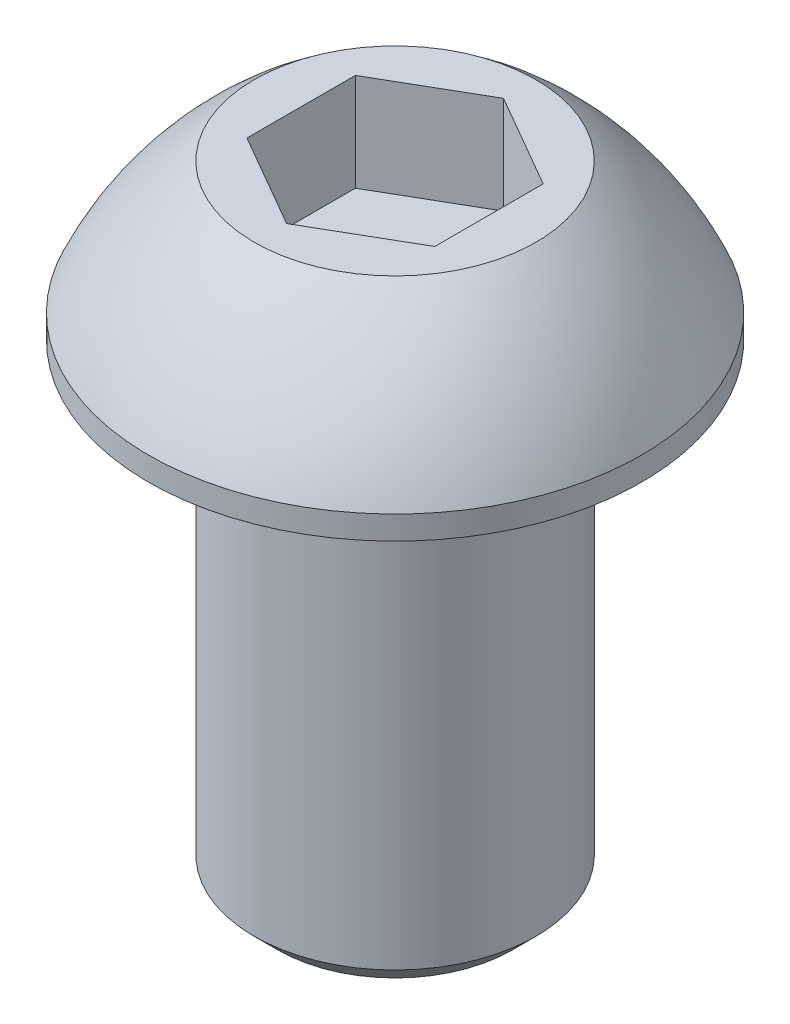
ISO-10303-21;
HEADER;
FILE_DESCRIPTION(('STEP AP214'),'2;1');
FILE_NAME('part.step','',(''),(''),'','','');
FILE_SCHEMA(('AUTOMOTIVE_DESIGN { 1 0 10303 214 1 1 1 1 }'));
ENDSEC;
DATA;
#1=APPLICATION_CONTEXT('core data for automotive mechanical design processes');
#2=APPLICATION_PROTOCOL_DEFINITION('international standard','automotive_design',2000,#1);
#3=PRODUCT_CONTEXT('',#1,'mechanical');
#4=PRODUCT('Part','Part','',(#3));
#5=PRODUCT_RELATED_PRODUCT_CATEGORY('part','',(#4));
#6=PRODUCT_DEFINITION_FORMATION('','',#4);
#7=PRODUCT_DEFINITION_CONTEXT('part definition',#1,'design');
#8=PRODUCT_DEFINITION('design','',#6,#7);
#9=PRODUCT_DEFINITION_SHAPE('','',#8);
#10=(LENGTH_UNIT() NAMED_UNIT(*) SI_UNIT(.MILLI.,.METRE.));
#11=(NAMED_UNIT(*) PLANE_ANGLE_UNIT() SI_UNIT($,.RADIAN.));
#12=(NAMED_UNIT(*) SI_UNIT($,.STERADIAN.) SOLID_ANGLE_UNIT());
#13=UNCERTAINTY_MEASURE_WITH_UNIT(LENGTH_MEASURE(1.E-05),#10,'distance_accuracy_value','');
#14=(GEOMETRIC_REPRESENTATION_CONTEXT(3) GLOBAL_UNCERTAINTY_ASSIGNED_CONTEXT((#13)) GLOBAL_UNIT_ASSIGNED_CONTEXT((#10,
#11,#12)) REPRESENTATION_CONTEXT('',''));
#15=CARTESIAN_POINT('',(0.,0.,0.));
#16=DIRECTION('',(0.,0.,1.));
#17=DIRECTION('',(1.,0.,0.));
#18=AXIS2_PLACEMENT_3D('',#15,#16,#17);
#19=CARTESIAN_POINT('',(0.,-10.,0.));
#20=DIRECTION('',(0.,1.,0.));
#21=DIRECTION('',(-1.,0.,0.));
#22=AXIS2_PLACEMENT_3D('',#19,#20,#21);
#23=PLANE('',#22);
#24=CARTESIAN_POINT('',(0.,-10.,0.));
#25=DIRECTION('',(0.,1.,0.));
#26=DIRECTION('',(-1.,0.,0.));
#27=AXIS2_PLACEMENT_3D('',#24,#25,#26);
#28=CIRCLE('',#27,2.5);
#29=CARTESIAN_POINT('',(-2.5,-10.,0.));
#30=VERTEX_POINT('',#29);
#31=EDGE_CURVE('E11',#30,#30,#28,.T.);
#32=ORIENTED_EDGE('',*,*,#31,.F.);
#33=EDGE_LOOP('',(#32));
#34=FACE_BOUND('',#33,.T.);
#35=ADVANCED_FACE('F39',(#34),#23,.F.);
#36=CARTESIAN_POINT('',(0.,-10.,0.));
#37=DIRECTION('',(0.,1.,0.));
#38=DIRECTION('',(-1.,0.,0.));
#39=AXIS2_PLACEMENT_3D('',#36,#37,#38);
#40=CONICAL_SURFACE('',#39,2.5,0.785398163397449);
#41=CARTESIAN_POINT('',(0.,-9.5,0.));
#42=DIRECTION('',(0.,1.,0.));
#43=DIRECTION('',(-1.,0.,0.));
#44=AXIS2_PLACEMENT_3D('',#41,#42,#43);
#45=CIRCLE('',#44,3.);
#46=CARTESIAN_POINT('',(-3.,-9.5,0.));
#47=VERTEX_POINT('',#46);
#48=EDGE_CURVE('E46',#47,#47,#45,.T.);
#49=ORIENTED_EDGE('',*,*,#48,.F.);
#50=EDGE_LOOP('',(#49));
#51=FACE_BOUND('',#50,.T.);
#52=ORIENTED_EDGE('',*,*,#31,.T.);
#53=EDGE_LOOP('',(#52));
#54=FACE_BOUND('',#53,.T.);
#55=ADVANCED_FACE('F164',(#51,#54),#40,.T.);
#56=CARTESIAN_POINT('',(0.,3.3,0.));
#57=DIRECTION('',(0.,1.,0.));
#58=DIRECTION('',(-1.,0.,0.));
#59=AXIS2_PLACEMENT_3D('',#56,#57,#58);
#60=CYLINDRICAL_SURFACE('',#59,3.);
#61=CARTESIAN_POINT('',(0.,-0.25,0.));
#62=DIRECTION('',(0.,1.,0.));
#63=DIRECTION('',(-1.,0.,0.));
#64=AXIS2_PLACEMENT_3D('',#61,#62,#63);
#65=CIRCLE('',#64,3.);
#66=CARTESIAN_POINT('',(-3.,-0.250000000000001,0.));
#67=VERTEX_POINT('',#66);
#68=EDGE_CURVE('E157',#67,#67,#65,.T.);
#69=ORIENTED_EDGE('',*,*,#68,.F.);
#70=EDGE_LOOP('',(#69));
#71=FACE_BOUND('',#70,.T.);
#72=ORIENTED_EDGE('',*,*,#48,.T.);
#73=EDGE_LOOP('',(#72));
#74=FACE_BOUND('',#73,.T.);
#75=ADVANCED_FACE('F162',(#71,#74),#60,.T.);
#76=CARTESIAN_POINT('',(0.,-0.25,0.));
#77=DIRECTION('',(0.,1.,0.));
#78=DIRECTION('',(-1.,0.,0.));
#79=AXIS2_PLACEMENT_3D('',#76,#77,#78);
#80=TOROIDAL_SURFACE('',#79,3.25,0.25);
#81=CARTESIAN_POINT('',(0.,0.,0.));
#82=DIRECTION('',(0.,1.,0.));
#83=DIRECTION('',(-1.,0.,0.));
#84=AXIS2_PLACEMENT_3D('',#81,#82,#83);
#85=CIRCLE('',#84,3.25);
#86=CARTESIAN_POINT('',(-3.25,0.,0.));
#87=VERTEX_POINT('',#86);
#88=EDGE_CURVE('E154',#87,#87,#85,.T.);
#89=ORIENTED_EDGE('',*,*,#88,.F.);
#90=EDGE_LOOP('',(#89));
#91=FACE_BOUND('',#90,.T.);
#92=ORIENTED_EDGE('',*,*,#68,.T.);
#93=EDGE_LOOP('',(#92));
#94=FACE_BOUND('',#93,.T.);
#95=ADVANCED_FACE('F183',(#91,#94),#80,.F.);
#96=CARTESIAN_POINT('',(3.25,0.,0.));
#97=DIRECTION('',(0.,1.,0.));
#98=DIRECTION('',(-1.,0.,0.));
#99=AXIS2_PLACEMENT_3D('',#96,#97,#98);
#100=PLANE('',#99);
#101=CARTESIAN_POINT('',(0.,0.,0.));
#102=DIRECTION('',(0.,1.,0.));
#103=DIRECTION('',(-1.,0.,0.));
#104=AXIS2_PLACEMENT_3D('',#101,#102,#103);
#105=CIRCLE('',#104,5.25);
#106=CARTESIAN_POINT('',(-5.25,0.,0.));
#107=VERTEX_POINT('',#106);
#108=EDGE_CURVE('E151',#107,#107,#105,.T.);
#109=ORIENTED_EDGE('',*,*,#108,.F.);
#110=EDGE_LOOP('',(#109));
#111=FACE_BOUND('',#110,.T.);
#112=ORIENTED_EDGE('',*,*,#88,.T.);
#113=EDGE_LOOP('',(#112));
#114=FACE_BOUND('',#113,.T.);
#115=ADVANCED_FACE('F191',(#111,#114),#100,.F.);
#116=CARTESIAN_POINT('',(0.,3.3,0.));
#117=DIRECTION('',(0.,1.,0.));
#118=DIRECTION('',(-1.,0.,0.));
#119=AXIS2_PLACEMENT_3D('',#116,#117,#118);
#120=CYLINDRICAL_SURFACE('',#119,5.25);
#121=CARTESIAN_POINT('',(0.,0.5,0.));
#122=DIRECTION('',(0.,1.,0.));
#123=DIRECTION('',(-1.,0.,0.));
#124=AXIS2_PLACEMENT_3D('',#121,#122,#123);
#125=CIRCLE('',#124,5.25);
#126=CARTESIAN_POINT('',(-5.25,0.499999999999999,0.));
#127=VERTEX_POINT('',#126);
#128=EDGE_CURVE('E148',#127,#127,#125,.T.);
#129=ORIENTED_EDGE('',*,*,#128,.F.);
#130=EDGE_LOOP('',(#129));
#131=FACE_BOUND('',#130,.T.);
#132=ORIENTED_EDGE('',*,*,#108,.T.);
#133=EDGE_LOOP('',(#132));
#134=FACE_BOUND('',#133,.T.);
#135=ADVANCED_FACE('F199',(#131,#134),#120,.T.);
#136=CARTESIAN_POINT('',(0.,-2.23418012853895,0.));
#137=DIRECTION('',(0.,1.,0.));
#138=DIRECTION('',(-1.,0.,0.));
#139=AXIS2_PLACEMENT_3D('',#136,#137,#138);
#140=DEGENERATE_TOROIDAL_SURFACE('',#139,1.01975749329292,6.84,.F.);
#141=CARTESIAN_POINT('',(0.,3.3,0.));
#142=DIRECTION('',(0.,1.,0.));
#143=DIRECTION('',(-1.,0.,0.));
#144=AXIS2_PLACEMENT_3D('',#141,#142,#143);
#145=CIRCLE('',#144,3.);
#146=CARTESIAN_POINT('',(-3.,3.3,0.));
#147=VERTEX_POINT('',#146);
#148=EDGE_CURVE('E140',#147,#147,#145,.T.);
#149=ORIENTED_EDGE('',*,*,#148,.F.);
#150=EDGE_LOOP('',(#149));
#151=FACE_BOUND('',#150,.T.);
#152=ORIENTED_EDGE('',*,*,#128,.T.);
#153=EDGE_LOOP('',(#152));
#154=FACE_BOUND('',#153,.T.);
#155=ADVANCED_FACE('F207',(#151,#154),#140,.F.);
#156=CARTESIAN_POINT('',(0.,3.3,0.));
#157=DIRECTION('',(0.,-1.,0.));
#158=DIRECTION('',(1.,0.,0.));
#159=AXIS2_PLACEMENT_3D('',#156,#157,#158);
#160=PLANE('',#159);
#161=DIRECTION('',(-0.866025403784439,0.,0.5));
#162=VECTOR('',#161,1.);
#163=CARTESIAN_POINT('',(0.,3.3,-2.3094010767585));
#164=LINE('',#163,#162);
#165=CARTESIAN_POINT('',(0.,3.3,-2.3094010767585));
#166=VERTEX_POINT('',#165);
#167=CARTESIAN_POINT('',(-2.,3.3,-1.15470053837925));
#168=VERTEX_POINT('',#167);
#169=EDGE_CURVE('E127',#166,#168,#164,.T.);
#170=ORIENTED_EDGE('',*,*,#169,.F.);
#171=DIRECTION('',(-0.866025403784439,0.,-0.5));
#172=VECTOR('',#171,1.);
#173=CARTESIAN_POINT('',(2.,3.3,-1.15470053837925));
#174=LINE('',#173,#172);
#175=CARTESIAN_POINT('',(2.,3.3,-1.15470053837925));
#176=VERTEX_POINT('',#175);
#177=EDGE_CURVE('E53',#176,#166,#174,.T.);
#178=ORIENTED_EDGE('',*,*,#177,.F.);
#179=DIRECTION('',(0.,0.,-1.));
#180=VECTOR('',#179,1.);
#181=CARTESIAN_POINT('',(2.,3.3,1.15470053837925));
#182=LINE('',#181,#180);
#183=CARTESIAN_POINT('',(2.,3.3,1.15470053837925));
#184=VERTEX_POINT('',#183);
#185=EDGE_CURVE('E136',#184,#176,#182,.T.);
#186=ORIENTED_EDGE('',*,*,#185,.F.);
#187=DIRECTION('',(0.866025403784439,0.,-0.5));
#188=VECTOR('',#187,1.);
#189=CARTESIAN_POINT('',(0.,3.3,2.3094010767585));
#190=LINE('',#189,#188);
#191=CARTESIAN_POINT('',(0.,3.3,2.3094010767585));
#192=VERTEX_POINT('',#191);
#193=EDGE_CURVE('E134',#192,#184,#190,.T.);
#194=ORIENTED_EDGE('',*,*,#193,.F.);
#195=DIRECTION('',(0.866025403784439,0.,0.5));
#196=VECTOR('',#195,1.);
#197=CARTESIAN_POINT('',(-2.,3.3,1.15470053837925));
#198=LINE('',#197,#196);
#199=CARTESIAN_POINT('',(-2.,3.3,1.15470053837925));
#200=VERTEX_POINT('',#199);
#201=EDGE_CURVE('E101',#200,#192,#198,.T.);
#202=ORIENTED_EDGE('',*,*,#201,.F.);
#203=DIRECTION('',(0.,0.,1.));
#204=VECTOR('',#203,1.);
#205=CARTESIAN_POINT('',(-2.,3.3,-1.15470053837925));
#206=LINE('',#205,#204);
#207=EDGE_CURVE('E130',#168,#200,#206,.T.);
#208=ORIENTED_EDGE('',*,*,#207,.F.);
#209=EDGE_LOOP('',(#170,#178,#186,#194,#202,#208));
#210=FACE_BOUND('',#209,.T.);
#211=ORIENTED_EDGE('',*,*,#148,.T.);
#212=EDGE_LOOP('',(#211));
#213=FACE_BOUND('',#212,.T.);
#214=ADVANCED_FACE('F215',(#210,#213),#160,.F.);
#215=CARTESIAN_POINT('',(2.,1.22,-1.15470053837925));
#216=DIRECTION('',(0.5,0.,-0.866025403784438));
#217=DIRECTION('',(-0.866025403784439,0.,-0.5));
#218=AXIS2_PLACEMENT_3D('',#215,#216,#217);
#219=PLANE('',#218);
#220=ORIENTED_EDGE('',*,*,#177,.T.);
#221=DIRECTION('',(0.,1.,0.));
#222=VECTOR('',#221,1.);
#223=CARTESIAN_POINT('',(0.,1.22,-2.3094010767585));
#224=LINE('',#223,#222);
#225=CARTESIAN_POINT('',(0.,1.22,-2.3094010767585));
#226=VERTEX_POINT('',#225);
#227=EDGE_CURVE('E83',#226,#166,#224,.T.);
#228=ORIENTED_EDGE('',*,*,#227,.F.);
#229=DIRECTION('',(-0.866025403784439,0.,-0.5));
#230=VECTOR('',#229,1.);
#231=CARTESIAN_POINT('',(2.,1.22,-1.15470053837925));
#232=LINE('',#231,#230);
#233=CARTESIAN_POINT('',(2.,1.22,-1.15470053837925));
#234=VERTEX_POINT('',#233);
#235=EDGE_CURVE('E138',#234,#226,#232,.T.);
#236=ORIENTED_EDGE('',*,*,#235,.F.);
#237=DIRECTION('',(0.,1.,0.));
#238=VECTOR('',#237,1.);
#239=CARTESIAN_POINT('',(2.,1.22,-1.15470053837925));
#240=LINE('',#239,#238);
#241=EDGE_CURVE('E61',#234,#176,#240,.T.);
#242=ORIENTED_EDGE('',*,*,#241,.T.);
#243=EDGE_LOOP('',(#220,#228,#236,#242));
#244=FACE_BOUND('',#243,.T.);
#245=ADVANCED_FACE('F223',(#244),#219,.F.);
#246=CARTESIAN_POINT('',(2.,1.22,1.15470053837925));
#247=DIRECTION('',(1.,0.,0.));
#248=DIRECTION('',(0.,1.,0.));
#249=AXIS2_PLACEMENT_3D('',#246,#247,#248);
#250=PLANE('',#249);
#251=ORIENTED_EDGE('',*,*,#185,.T.);
#252=ORIENTED_EDGE('',*,*,#241,.F.);
#253=DIRECTION('',(0.,0.,-1.));
#254=VECTOR('',#253,1.);
#255=CARTESIAN_POINT('',(2.,1.22,1.15470053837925));
#256=LINE('',#255,#254);
#257=CARTESIAN_POINT('',(2.,1.22,1.15470053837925));
#258=VERTEX_POINT('',#257);
#259=EDGE_CURVE('E113',#258,#234,#256,.T.);
#260=ORIENTED_EDGE('',*,*,#259,.F.);
#261=DIRECTION('',(0.,1.,0.));
#262=VECTOR('',#261,1.);
#263=CARTESIAN_POINT('',(2.,1.22,1.15470053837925));
#264=LINE('',#263,#262);
#265=EDGE_CURVE('E105',#258,#184,#264,.T.);
#266=ORIENTED_EDGE('',*,*,#265,.T.);
#267=EDGE_LOOP('',(#251,#252,#260,#266));
#268=FACE_BOUND('',#267,.T.);
#269=ADVANCED_FACE('F231',(#268),#250,.F.);
#270=CARTESIAN_POINT('',(0.,1.22,2.3094010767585));
#271=DIRECTION('',(0.5,0.,0.866025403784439));
#272=DIRECTION('',(0.866025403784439,0.,-0.5));
#273=AXIS2_PLACEMENT_3D('',#270,#271,#272);
#274=PLANE('',#273);
#275=ORIENTED_EDGE('',*,*,#193,.T.);
#276=ORIENTED_EDGE('',*,*,#265,.F.);
#277=DIRECTION('',(0.866025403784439,0.,-0.5));
#278=VECTOR('',#277,1.);
#279=CARTESIAN_POINT('',(0.,1.22,2.3094010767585));
#280=LINE('',#279,#278);
#281=CARTESIAN_POINT('',(0.,1.22,2.3094010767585));
#282=VERTEX_POINT('',#281);
#283=EDGE_CURVE('E109',#282,#258,#280,.T.);
#284=ORIENTED_EDGE('',*,*,#283,.F.);
#285=DIRECTION('',(0.,1.,0.));
#286=VECTOR('',#285,1.);
#287=CARTESIAN_POINT('',(0.,1.22,2.3094010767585));
#288=LINE('',#287,#286);
#289=EDGE_CURVE('E94',#282,#192,#288,.T.);
#290=ORIENTED_EDGE('',*,*,#289,.T.);
#291=EDGE_LOOP('',(#275,#276,#284,#290));
#292=FACE_BOUND('',#291,.T.);
#293=ADVANCED_FACE('F110',(#292),#274,.F.);
#294=CARTESIAN_POINT('',(-2.,1.22,1.15470053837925));
#295=DIRECTION('',(-0.5,0.,0.866025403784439));
#296=DIRECTION('',(0.866025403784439,0.,0.5));
#297=AXIS2_PLACEMENT_3D('',#294,#295,#296);
#298=PLANE('',#297);
#299=ORIENTED_EDGE('',*,*,#201,.T.);
#300=ORIENTED_EDGE('',*,*,#289,.F.);
#301=DIRECTION('',(0.866025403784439,0.,0.5));
#302=VECTOR('',#301,1.);
#303=CARTESIAN_POINT('',(-2.,1.22,1.15470053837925));
#304=LINE('',#303,#302);
#305=CARTESIAN_POINT('',(-2.,1.22,1.15470053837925));
#306=VERTEX_POINT('',#305);
#307=EDGE_CURVE('E98',#306,#282,#304,.T.);
#308=ORIENTED_EDGE('',*,*,#307,.F.);
#309=DIRECTION('',(0.,1.,0.));
#310=VECTOR('',#309,1.);
#311=CARTESIAN_POINT('',(-2.,1.22,1.15470053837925));
#312=LINE('',#311,#310);
#313=EDGE_CURVE('E106',#306,#200,#312,.T.);
#314=ORIENTED_EDGE('',*,*,#313,.T.);
#315=EDGE_LOOP('',(#299,#300,#308,#314));
#316=FACE_BOUND('',#315,.T.);
#317=ADVANCED_FACE('F96',(#316),#298,.F.);
#318=CARTESIAN_POINT('',(-2.,1.22,-1.15470053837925));
#319=DIRECTION('',(-1.,0.,0.));
#320=DIRECTION('',(0.,-1.,0.));
#321=AXIS2_PLACEMENT_3D('',#318,#319,#320);
#322=PLANE('',#321);
#323=ORIENTED_EDGE('',*,*,#207,.T.);
#324=ORIENTED_EDGE('',*,*,#313,.F.);
#325=DIRECTION('',(0.,0.,1.));
#326=VECTOR('',#325,1.);
#327=CARTESIAN_POINT('',(-2.,1.22,-1.15470053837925));
#328=LINE('',#327,#326);
#329=CARTESIAN_POINT('',(-2.,1.22,-1.15470053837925));
#330=VERTEX_POINT('',#329);
#331=EDGE_CURVE('E119',#330,#306,#328,.T.);
#332=ORIENTED_EDGE('',*,*,#331,.F.);
#333=DIRECTION('',(0.,1.,0.));
#334=VECTOR('',#333,1.);
#335=CARTESIAN_POINT('',(-2.,1.22,-1.15470053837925));
#336=LINE('',#335,#334);
#337=EDGE_CURVE('E143',#330,#168,#336,.T.);
#338=ORIENTED_EDGE('',*,*,#337,.T.);
#339=EDGE_LOOP('',(#323,#324,#332,#338));
#340=FACE_BOUND('',#339,.T.);
#341=ADVANCED_FACE('F250',(#340),#322,.F.);
#342=CARTESIAN_POINT('',(0.,1.22,-2.3094010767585));
#343=DIRECTION('',(-0.5,0.,-0.866025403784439));
#344=DIRECTION('',(-0.866025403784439,0.,0.5));
#345=AXIS2_PLACEMENT_3D('',#342,#343,#344);
#346=PLANE('',#345);
#347=ORIENTED_EDGE('',*,*,#169,.T.);
#348=ORIENTED_EDGE('',*,*,#337,.F.);
#349=DIRECTION('',(-0.866025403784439,0.,0.5));
#350=VECTOR('',#349,1.);
#351=CARTESIAN_POINT('',(0.,1.22,-2.3094010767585));
#352=LINE('',#351,#350);
#353=EDGE_CURVE('E121',#226,#330,#352,.T.);
#354=ORIENTED_EDGE('',*,*,#353,.F.);
#355=ORIENTED_EDGE('',*,*,#227,.T.);
#356=EDGE_LOOP('',(#347,#348,#354,#355));
#357=FACE_BOUND('',#356,.T.);
#358=ADVANCED_FACE('F257',(#357),#346,.F.);
#359=CARTESIAN_POINT('',(-2.,1.22,-3.46410161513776));
#360=DIRECTION('',(0.,1.,0.));
#361=DIRECTION('',(0.,0.,1.));
#362=AXIS2_PLACEMENT_3D('',#359,#360,#361);
#363=PLANE('',#362);
#364=ORIENTED_EDGE('',*,*,#235,.T.);
#365=ORIENTED_EDGE('',*,*,#353,.T.);
#366=ORIENTED_EDGE('',*,*,#331,.T.);
#367=ORIENTED_EDGE('',*,*,#307,.T.);
#368=ORIENTED_EDGE('',*,*,#283,.T.);
#369=ORIENTED_EDGE('',*,*,#259,.T.);
#370=EDGE_LOOP('',(#364,#365,#366,#367,#368,#369));
#371=FACE_BOUND('',#370,.T.);
#372=ADVANCED_FACE('F116',(#371),#363,.T.);
#373=CLOSED_SHELL('',(#35,#55,#75,#95,#115,#135,#155,#214,#245,#269,#293,#317,#341,#358,#372));
#374=MANIFOLD_SOLID_BREP('B2',#373);
#375=ADVANCED_BREP_SHAPE_REPRESENTATION('',(#18,#374),#14);
#376=SHAPE_DEFINITION_REPRESENTATION(#9,#375);
ENDSEC;
END-ISO-10303-21;
